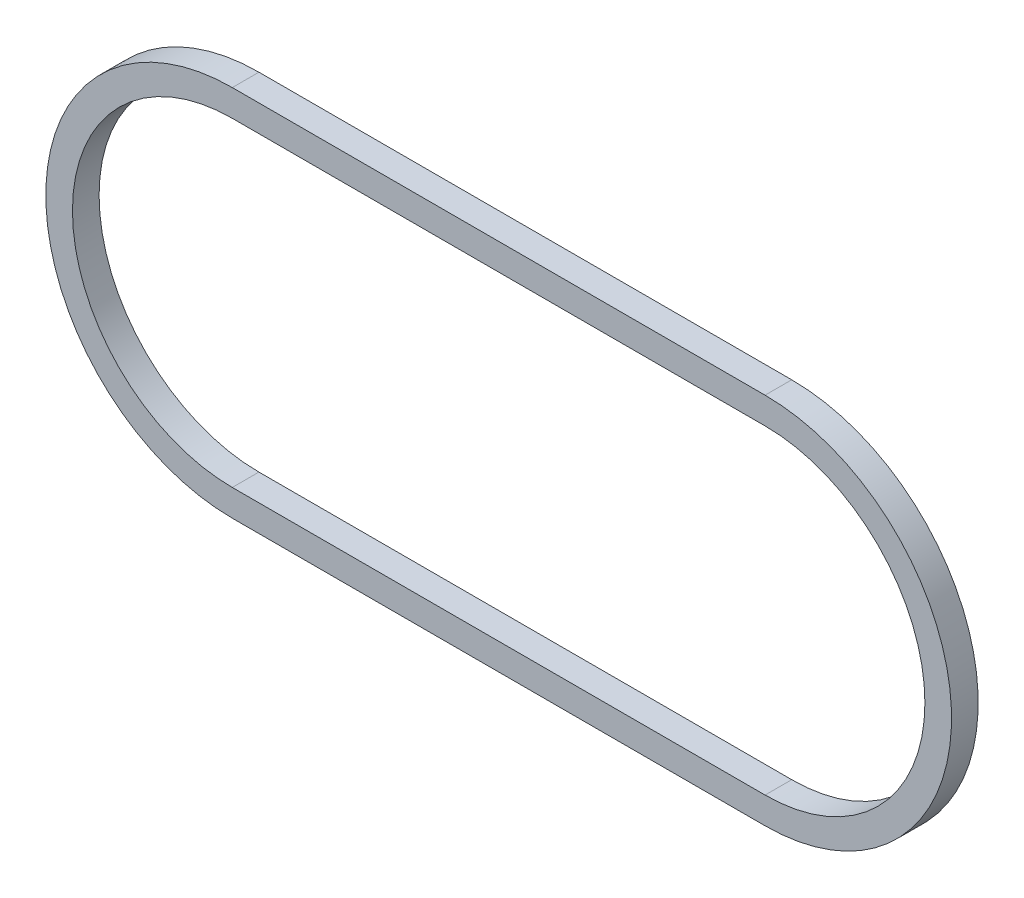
ISO-10303-21;
HEADER;
FILE_DESCRIPTION(('STEP AP214'),'2;1');
FILE_NAME('part.step','',(''),(''),'','','');
FILE_SCHEMA(('AUTOMOTIVE_DESIGN { 1 0 10303 214 1 1 1 1 }'));
ENDSEC;
DATA;
#1=APPLICATION_CONTEXT('core data for automotive mechanical design processes');
#2=APPLICATION_PROTOCOL_DEFINITION('international standard','automotive_design',2000,#1);
#3=PRODUCT_CONTEXT('',#1,'mechanical');
#4=PRODUCT('Part','Part','',(#3));
#5=PRODUCT_RELATED_PRODUCT_CATEGORY('part','',(#4));
#6=PRODUCT_DEFINITION_FORMATION('','',#4);
#7=PRODUCT_DEFINITION_CONTEXT('part definition',#1,'design');
#8=PRODUCT_DEFINITION('design','',#6,#7);
#9=PRODUCT_DEFINITION_SHAPE('','',#8);
#10=(LENGTH_UNIT() NAMED_UNIT(*) SI_UNIT(.MILLI.,.METRE.));
#11=(NAMED_UNIT(*) PLANE_ANGLE_UNIT() SI_UNIT($,.RADIAN.));
#12=(NAMED_UNIT(*) SI_UNIT($,.STERADIAN.) SOLID_ANGLE_UNIT());
#13=UNCERTAINTY_MEASURE_WITH_UNIT(LENGTH_MEASURE(1.E-05),#10,'distance_accuracy_value','');
#14=(GEOMETRIC_REPRESENTATION_CONTEXT(3) GLOBAL_UNCERTAINTY_ASSIGNED_CONTEXT((#13)) GLOBAL_UNIT_ASSIGNED_CONTEXT((#10,
#11,#12)) REPRESENTATION_CONTEXT('',''));
#15=CARTESIAN_POINT('',(0.,0.,0.));
#16=DIRECTION('',(0.,0.,1.));
#17=DIRECTION('',(1.,0.,0.));
#18=AXIS2_PLACEMENT_3D('',#15,#16,#17);
#19=CARTESIAN_POINT('',(63.5,0.,3.175));
#20=DIRECTION('',(0.,0.,-1.));
#21=DIRECTION('',(-1.,0.,0.));
#22=AXIS2_PLACEMENT_3D('',#19,#20,#21);
#23=PLANE('',#22);
#24=CARTESIAN_POINT('',(63.5,0.,3.175));
#25=DIRECTION('',(0.,0.,1.));
#26=DIRECTION('',(-1.,0.,0.));
#27=AXIS2_PLACEMENT_3D('',#24,#25,#26);
#28=CIRCLE('',#27,44.45);
#29=CARTESIAN_POINT('',(63.5,-44.45,3.175));
#30=VERTEX_POINT('',#29);
#31=CARTESIAN_POINT('',(63.5,44.45,3.175));
#32=VERTEX_POINT('',#31);
#33=EDGE_CURVE('E145',#30,#32,#28,.T.);
#34=ORIENTED_EDGE('',*,*,#33,.T.);
#35=DIRECTION('',(-1.,0.,0.));
#36=VECTOR('',#35,1.);
#37=CARTESIAN_POINT('',(-63.5,44.45,3.175));
#38=LINE('',#37,#36);
#39=CARTESIAN_POINT('',(-63.5,44.45,3.175));
#40=VERTEX_POINT('',#39);
#41=EDGE_CURVE('E144',#32,#40,#38,.T.);
#42=ORIENTED_EDGE('',*,*,#41,.T.);
#43=CARTESIAN_POINT('',(-63.5,0.,3.175));
#44=DIRECTION('',(0.,0.,1.));
#45=DIRECTION('',(-1.,0.,0.));
#46=AXIS2_PLACEMENT_3D('',#43,#44,#45);
#47=CIRCLE('',#46,44.45);
#48=CARTESIAN_POINT('',(-63.5,-44.45,3.175));
#49=VERTEX_POINT('',#48);
#50=EDGE_CURVE('E149',#40,#49,#47,.T.);
#51=ORIENTED_EDGE('',*,*,#50,.T.);
#52=DIRECTION('',(1.,0.,0.));
#53=VECTOR('',#52,1.);
#54=CARTESIAN_POINT('',(-63.5,-44.45,3.175));
#55=LINE('',#54,#53);
#56=EDGE_CURVE('E148',#49,#30,#55,.T.);
#57=ORIENTED_EDGE('',*,*,#56,.T.);
#58=EDGE_LOOP('',(#34,#42,#51,#57));
#59=FACE_BOUND('',#58,.T.);
#60=CARTESIAN_POINT('',(63.5,0.,3.175));
#61=DIRECTION('',(0.,0.,1.));
#62=DIRECTION('',(-1.,0.,0.));
#63=AXIS2_PLACEMENT_3D('',#60,#61,#62);
#64=CIRCLE('',#63,38.1);
#65=CARTESIAN_POINT('',(63.5,-38.1,3.175));
#66=VERTEX_POINT('',#65);
#67=CARTESIAN_POINT('',(63.5,38.1,3.175));
#68=VERTEX_POINT('',#67);
#69=EDGE_CURVE('E107',#66,#68,#64,.T.);
#70=ORIENTED_EDGE('',*,*,#69,.F.);
#71=DIRECTION('',(1.,0.,0.));
#72=VECTOR('',#71,1.);
#73=CARTESIAN_POINT('',(-63.5,-38.1,3.175));
#74=LINE('',#73,#72);
#75=CARTESIAN_POINT('',(-63.5,-38.1,3.175));
#76=VERTEX_POINT('',#75);
#77=EDGE_CURVE('E126',#76,#66,#74,.T.);
#78=ORIENTED_EDGE('',*,*,#77,.F.);
#79=CARTESIAN_POINT('',(-63.5,0.,3.175));
#80=DIRECTION('',(0.,0.,1.));
#81=DIRECTION('',(-1.,0.,0.));
#82=AXIS2_PLACEMENT_3D('',#79,#80,#81);
#83=CIRCLE('',#82,38.1);
#84=CARTESIAN_POINT('',(-63.5,38.1,3.175));
#85=VERTEX_POINT('',#84);
#86=EDGE_CURVE('E128',#85,#76,#83,.T.);
#87=ORIENTED_EDGE('',*,*,#86,.F.);
#88=DIRECTION('',(-1.,0.,0.));
#89=VECTOR('',#88,1.);
#90=CARTESIAN_POINT('',(-63.5,38.1,3.175));
#91=LINE('',#90,#89);
#92=EDGE_CURVE('E114',#68,#85,#91,.T.);
#93=ORIENTED_EDGE('',*,*,#92,.F.);
#94=EDGE_LOOP('',(#70,#78,#87,#93));
#95=FACE_BOUND('',#94,.T.);
#96=ADVANCED_FACE('F41',(#59,#95),#23,.F.);
#97=CARTESIAN_POINT('',(63.5,0.,-3.175));
#98=DIRECTION('',(0.,0.,-1.));
#99=DIRECTION('',(-1.,0.,0.));
#100=AXIS2_PLACEMENT_3D('',#97,#98,#99);
#101=PLANE('',#100);
#102=CARTESIAN_POINT('',(63.5,0.,-3.175));
#103=DIRECTION('',(0.,0.,1.));
#104=DIRECTION('',(-1.,0.,0.));
#105=AXIS2_PLACEMENT_3D('',#102,#103,#104);
#106=CIRCLE('',#105,44.45);
#107=CARTESIAN_POINT('',(63.5,-44.45,-3.175));
#108=VERTEX_POINT('',#107);
#109=CARTESIAN_POINT('',(63.5,44.45,-3.175));
#110=VERTEX_POINT('',#109);
#111=EDGE_CURVE('E122',#108,#110,#106,.T.);
#112=ORIENTED_EDGE('',*,*,#111,.F.);
#113=DIRECTION('',(1.,0.,0.));
#114=VECTOR('',#113,1.);
#115=CARTESIAN_POINT('',(-63.5,-44.45,-3.175));
#116=LINE('',#115,#114);
#117=CARTESIAN_POINT('',(-63.5,-44.45,-3.175));
#118=VERTEX_POINT('',#117);
#119=EDGE_CURVE('E147',#118,#108,#116,.T.);
#120=ORIENTED_EDGE('',*,*,#119,.F.);
#121=CARTESIAN_POINT('',(-63.5,0.,-3.175));
#122=DIRECTION('',(0.,0.,1.));
#123=DIRECTION('',(-1.,0.,0.));
#124=AXIS2_PLACEMENT_3D('',#121,#122,#123);
#125=CIRCLE('',#124,44.45);
#126=CARTESIAN_POINT('',(-63.5,44.45,-3.175));
#127=VERTEX_POINT('',#126);
#128=EDGE_CURVE('E160',#127,#118,#125,.T.);
#129=ORIENTED_EDGE('',*,*,#128,.F.);
#130=DIRECTION('',(-1.,0.,0.));
#131=VECTOR('',#130,1.);
#132=CARTESIAN_POINT('',(-63.5,44.45,-3.175));
#133=LINE('',#132,#131);
#134=EDGE_CURVE('E153',#110,#127,#133,.T.);
#135=ORIENTED_EDGE('',*,*,#134,.F.);
#136=EDGE_LOOP('',(#112,#120,#129,#135));
#137=FACE_BOUND('',#136,.T.);
#138=DIRECTION('',(1.,0.,0.));
#139=VECTOR('',#138,1.);
#140=CARTESIAN_POINT('',(-63.5,-38.1,-3.175));
#141=LINE('',#140,#139);
#142=CARTESIAN_POINT('',(-63.5,-38.1,-3.175));
#143=VERTEX_POINT('',#142);
#144=CARTESIAN_POINT('',(63.5,-38.1,-3.175));
#145=VERTEX_POINT('',#144);
#146=EDGE_CURVE('E113',#143,#145,#141,.T.);
#147=ORIENTED_EDGE('',*,*,#146,.T.);
#148=CARTESIAN_POINT('',(63.5,0.,-3.175));
#149=DIRECTION('',(0.,0.,1.));
#150=DIRECTION('',(-1.,0.,0.));
#151=AXIS2_PLACEMENT_3D('',#148,#149,#150);
#152=CIRCLE('',#151,38.1);
#153=CARTESIAN_POINT('',(63.5,38.1,-3.175));
#154=VERTEX_POINT('',#153);
#155=EDGE_CURVE('E61',#145,#154,#152,.T.);
#156=ORIENTED_EDGE('',*,*,#155,.T.);
#157=DIRECTION('',(-1.,0.,0.));
#158=VECTOR('',#157,1.);
#159=CARTESIAN_POINT('',(-63.5,38.1,-3.175));
#160=LINE('',#159,#158);
#161=CARTESIAN_POINT('',(-63.5,38.1,-3.175));
#162=VERTEX_POINT('',#161);
#163=EDGE_CURVE('E123',#154,#162,#160,.T.);
#164=ORIENTED_EDGE('',*,*,#163,.T.);
#165=CARTESIAN_POINT('',(-63.5,0.,-3.175));
#166=DIRECTION('',(0.,0.,1.));
#167=DIRECTION('',(-1.,0.,0.));
#168=AXIS2_PLACEMENT_3D('',#165,#166,#167);
#169=CIRCLE('',#168,38.1);
#170=EDGE_CURVE('E132',#162,#143,#169,.T.);
#171=ORIENTED_EDGE('',*,*,#170,.T.);
#172=EDGE_LOOP('',(#147,#156,#164,#171));
#173=FACE_BOUND('',#172,.T.);
#174=ADVANCED_FACE('F172',(#137,#173),#101,.T.);
#175=CARTESIAN_POINT('',(63.5,0.,3.175));
#176=DIRECTION('',(0.,0.,-1.));
#177=DIRECTION('',(-1.,0.,0.));
#178=AXIS2_PLACEMENT_3D('',#175,#176,#177);
#179=CYLINDRICAL_SURFACE('',#178,44.45);
#180=ORIENTED_EDGE('',*,*,#111,.T.);
#181=DIRECTION('',(0.,0.,-1.));
#182=VECTOR('',#181,1.);
#183=CARTESIAN_POINT('',(63.5,44.45,3.175));
#184=LINE('',#183,#182);
#185=EDGE_CURVE('E11',#32,#110,#184,.T.);
#186=ORIENTED_EDGE('',*,*,#185,.F.);
#187=ORIENTED_EDGE('',*,*,#33,.F.);
#188=DIRECTION('',(0.,0.,-1.));
#189=VECTOR('',#188,1.);
#190=CARTESIAN_POINT('',(63.5,-44.45,3.175));
#191=LINE('',#190,#189);
#192=EDGE_CURVE('E154',#30,#108,#191,.T.);
#193=ORIENTED_EDGE('',*,*,#192,.T.);
#194=EDGE_LOOP('',(#180,#186,#187,#193));
#195=FACE_BOUND('',#194,.T.);
#196=ADVANCED_FACE('F43',(#195),#179,.T.);
#197=CARTESIAN_POINT('',(-63.5,44.45,3.175));
#198=DIRECTION('',(0.,-1.,0.));
#199=DIRECTION('',(0.,0.,-1.));
#200=AXIS2_PLACEMENT_3D('',#197,#198,#199);
#201=PLANE('',#200);
#202=ORIENTED_EDGE('',*,*,#134,.T.);
#203=DIRECTION('',(0.,0.,-1.));
#204=VECTOR('',#203,1.);
#205=CARTESIAN_POINT('',(-63.5,44.45,3.175));
#206=LINE('',#205,#204);
#207=EDGE_CURVE('E47',#40,#127,#206,.T.);
#208=ORIENTED_EDGE('',*,*,#207,.F.);
#209=ORIENTED_EDGE('',*,*,#41,.F.);
#210=ORIENTED_EDGE('',*,*,#185,.T.);
#211=EDGE_LOOP('',(#202,#208,#209,#210));
#212=FACE_BOUND('',#211,.T.);
#213=ADVANCED_FACE('F184',(#212),#201,.F.);
#214=CARTESIAN_POINT('',(-63.5,0.,3.175));
#215=DIRECTION('',(0.,0.,-1.));
#216=DIRECTION('',(-1.,0.,0.));
#217=AXIS2_PLACEMENT_3D('',#214,#215,#216);
#218=CYLINDRICAL_SURFACE('',#217,44.45);
#219=ORIENTED_EDGE('',*,*,#128,.T.);
#220=DIRECTION('',(0.,0.,-1.));
#221=VECTOR('',#220,1.);
#222=CARTESIAN_POINT('',(-63.5,-44.45,3.175));
#223=LINE('',#222,#221);
#224=EDGE_CURVE('E164',#49,#118,#223,.T.);
#225=ORIENTED_EDGE('',*,*,#224,.F.);
#226=ORIENTED_EDGE('',*,*,#50,.F.);
#227=ORIENTED_EDGE('',*,*,#207,.T.);
#228=EDGE_LOOP('',(#219,#225,#226,#227));
#229=FACE_BOUND('',#228,.T.);
#230=ADVANCED_FACE('F170',(#229),#218,.T.);
#231=CARTESIAN_POINT('',(-63.5,-44.45,3.175));
#232=DIRECTION('',(0.,1.,0.));
#233=DIRECTION('',(0.,0.,1.));
#234=AXIS2_PLACEMENT_3D('',#231,#232,#233);
#235=PLANE('',#234);
#236=ORIENTED_EDGE('',*,*,#119,.T.);
#237=ORIENTED_EDGE('',*,*,#192,.F.);
#238=ORIENTED_EDGE('',*,*,#56,.F.);
#239=ORIENTED_EDGE('',*,*,#224,.T.);
#240=EDGE_LOOP('',(#236,#237,#238,#239));
#241=FACE_BOUND('',#240,.T.);
#242=ADVANCED_FACE('F177',(#241),#235,.F.);
#243=CARTESIAN_POINT('',(63.5,0.,3.175));
#244=DIRECTION('',(0.,0.,-1.));
#245=DIRECTION('',(-1.,0.,0.));
#246=AXIS2_PLACEMENT_3D('',#243,#244,#245);
#247=CYLINDRICAL_SURFACE('',#246,38.1);
#248=ORIENTED_EDGE('',*,*,#155,.F.);
#249=DIRECTION('',(0.,0.,-1.));
#250=VECTOR('',#249,1.);
#251=CARTESIAN_POINT('',(63.5,-38.1,3.175));
#252=LINE('',#251,#250);
#253=EDGE_CURVE('E108',#66,#145,#252,.T.);
#254=ORIENTED_EDGE('',*,*,#253,.F.);
#255=ORIENTED_EDGE('',*,*,#69,.T.);
#256=DIRECTION('',(0.,0.,-1.));
#257=VECTOR('',#256,1.);
#258=CARTESIAN_POINT('',(63.5,38.1,3.175));
#259=LINE('',#258,#257);
#260=EDGE_CURVE('E106',#68,#154,#259,.T.);
#261=ORIENTED_EDGE('',*,*,#260,.T.);
#262=EDGE_LOOP('',(#248,#254,#255,#261));
#263=FACE_BOUND('',#262,.T.);
#264=ADVANCED_FACE('F110',(#263),#247,.F.);
#265=CARTESIAN_POINT('',(-63.5,38.1,3.175));
#266=DIRECTION('',(0.,-1.,0.));
#267=DIRECTION('',(0.,0.,-1.));
#268=AXIS2_PLACEMENT_3D('',#265,#266,#267);
#269=PLANE('',#268);
#270=ORIENTED_EDGE('',*,*,#163,.F.);
#271=ORIENTED_EDGE('',*,*,#260,.F.);
#272=ORIENTED_EDGE('',*,*,#92,.T.);
#273=DIRECTION('',(0.,0.,-1.));
#274=VECTOR('',#273,1.);
#275=CARTESIAN_POINT('',(-63.5,38.1,3.175));
#276=LINE('',#275,#274);
#277=EDGE_CURVE('E121',#85,#162,#276,.T.);
#278=ORIENTED_EDGE('',*,*,#277,.T.);
#279=EDGE_LOOP('',(#270,#271,#272,#278));
#280=FACE_BOUND('',#279,.T.);
#281=ADVANCED_FACE('F120',(#280),#269,.T.);
#282=CARTESIAN_POINT('',(-63.5,0.,3.175));
#283=DIRECTION('',(0.,0.,-1.));
#284=DIRECTION('',(-1.,0.,0.));
#285=AXIS2_PLACEMENT_3D('',#282,#283,#284);
#286=CYLINDRICAL_SURFACE('',#285,38.1);
#287=ORIENTED_EDGE('',*,*,#170,.F.);
#288=ORIENTED_EDGE('',*,*,#277,.F.);
#289=ORIENTED_EDGE('',*,*,#86,.T.);
#290=DIRECTION('',(0.,0.,-1.));
#291=VECTOR('',#290,1.);
#292=CARTESIAN_POINT('',(-63.5,-38.1,3.175));
#293=LINE('',#292,#291);
#294=EDGE_CURVE('E57',#76,#143,#293,.T.);
#295=ORIENTED_EDGE('',*,*,#294,.T.);
#296=EDGE_LOOP('',(#287,#288,#289,#295));
#297=FACE_BOUND('',#296,.T.);
#298=ADVANCED_FACE('F210',(#297),#286,.F.);
#299=CARTESIAN_POINT('',(-63.5,-38.1,3.175));
#300=DIRECTION('',(0.,1.,0.));
#301=DIRECTION('',(0.,0.,1.));
#302=AXIS2_PLACEMENT_3D('',#299,#300,#301);
#303=PLANE('',#302);
#304=ORIENTED_EDGE('',*,*,#146,.F.);
#305=ORIENTED_EDGE('',*,*,#294,.F.);
#306=ORIENTED_EDGE('',*,*,#77,.T.);
#307=ORIENTED_EDGE('',*,*,#253,.T.);
#308=EDGE_LOOP('',(#304,#305,#306,#307));
#309=FACE_BOUND('',#308,.T.);
#310=ADVANCED_FACE('F212',(#309),#303,.T.);
#311=CLOSED_SHELL('',(#96,#174,#196,#213,#230,#242,#264,#281,#298,#310));
#312=MANIFOLD_SOLID_BREP('B2',#311);
#313=ADVANCED_BREP_SHAPE_REPRESENTATION('',(#18,#312),#14);
#314=SHAPE_DEFINITION_REPRESENTATION(#9,#313);
ENDSEC;
END-ISO-10303-21;
